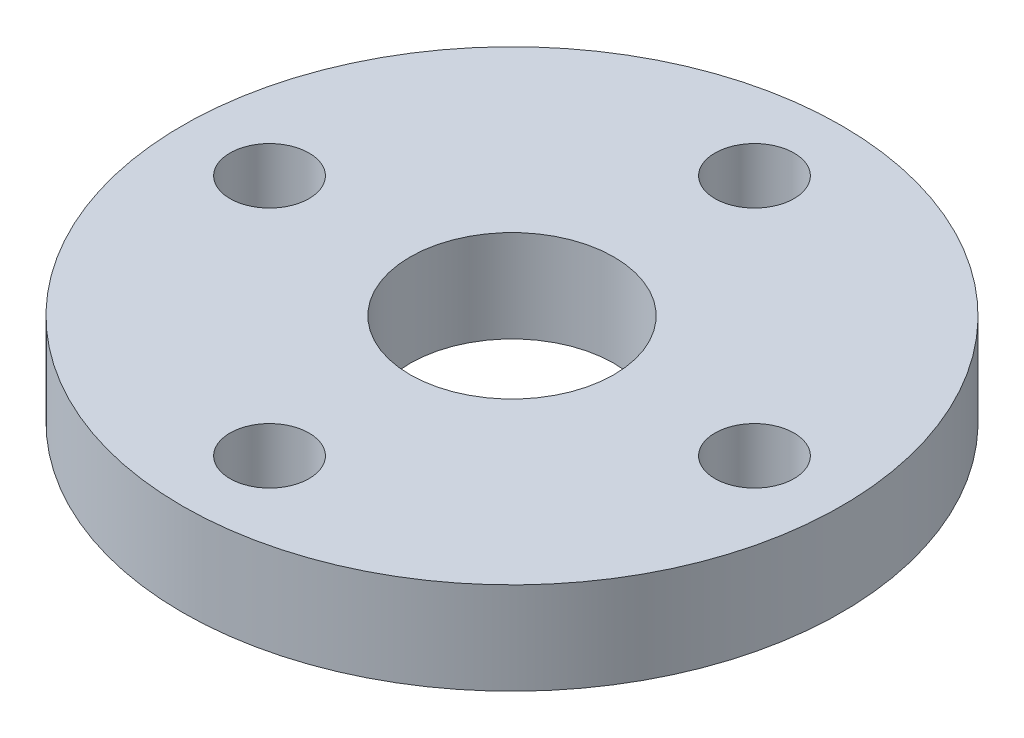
ISO-10303-21;
HEADER;
FILE_DESCRIPTION(('STEP AP214'),'2;1');
FILE_NAME('part.step','',(''),(''),'','','');
FILE_SCHEMA(('AUTOMOTIVE_DESIGN { 1 0 10303 214 1 1 1 1 }'));
ENDSEC;
DATA;
#1=APPLICATION_CONTEXT('core data for automotive mechanical design processes');
#2=APPLICATION_PROTOCOL_DEFINITION('international standard','automotive_design',2000,#1);
#3=PRODUCT_CONTEXT('',#1,'mechanical');
#4=PRODUCT('Part','Part','',(#3));
#5=PRODUCT_RELATED_PRODUCT_CATEGORY('part','',(#4));
#6=PRODUCT_DEFINITION_FORMATION('','',#4);
#7=PRODUCT_DEFINITION_CONTEXT('part definition',#1,'design');
#8=PRODUCT_DEFINITION('design','',#6,#7);
#9=PRODUCT_DEFINITION_SHAPE('','',#8);
#10=(LENGTH_UNIT() NAMED_UNIT(*) SI_UNIT(.MILLI.,.METRE.));
#11=(NAMED_UNIT(*) PLANE_ANGLE_UNIT() SI_UNIT($,.RADIAN.));
#12=(NAMED_UNIT(*) SI_UNIT($,.STERADIAN.) SOLID_ANGLE_UNIT());
#13=UNCERTAINTY_MEASURE_WITH_UNIT(LENGTH_MEASURE(1.E-05),#10,'distance_accuracy_value','');
#14=(GEOMETRIC_REPRESENTATION_CONTEXT(3) GLOBAL_UNCERTAINTY_ASSIGNED_CONTEXT((#13)) GLOBAL_UNIT_ASSIGNED_CONTEXT((#10,
#11,#12)) REPRESENTATION_CONTEXT('',''));
#15=CARTESIAN_POINT('',(0.,0.,0.));
#16=DIRECTION('',(0.,0.,1.));
#17=DIRECTION('',(1.,0.,0.));
#18=AXIS2_PLACEMENT_3D('',#15,#16,#17);
#19=CARTESIAN_POINT('',(0.,15.0876,0.));
#20=DIRECTION('',(0.,1.,0.));
#21=DIRECTION('',(0.,0.,1.));
#22=AXIS2_PLACEMENT_3D('',#19,#20,#21);
#23=PLANE('',#22);
#24=CARTESIAN_POINT('',(-39.7156471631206,15.0876,-4.1599956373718E-13));
#25=DIRECTION('',(0.,1.,0.));
#26=DIRECTION('',(1.,0.,0.));
#27=AXIS2_PLACEMENT_3D('',#24,#25,#26);
#28=CIRCLE('',#27,6.477);
#29=CARTESIAN_POINT('',(-33.2386471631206,15.0876,-3.48156550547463E-13));
#30=VERTEX_POINT('',#29);
#31=EDGE_CURVE('E72',#30,#30,#28,.T.);
#32=ORIENTED_EDGE('',*,*,#31,.F.);
#33=EDGE_LOOP('',(#32));
#34=FACE_BOUND('',#33,.T.);
#35=CARTESIAN_POINT('',(-2.77333042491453E-13,15.0876,39.7156471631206));
#36=DIRECTION('',(0.,1.,0.));
#37=DIRECTION('',(0.,0.,-1.));
#38=AXIS2_PLACEMENT_3D('',#35,#36,#37);
#39=CIRCLE('',#38,6.477);
#40=CARTESIAN_POINT('',(-2.32104367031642E-13,15.0876,33.2386471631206));
#41=VERTEX_POINT('',#40);
#42=EDGE_CURVE('E66',#41,#41,#39,.T.);
#43=ORIENTED_EDGE('',*,*,#42,.F.);
#44=EDGE_LOOP('',(#43));
#45=FACE_BOUND('',#44,.T.);
#46=CARTESIAN_POINT('',(39.7156471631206,15.0876,1.38666521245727E-13));
#47=DIRECTION('',(0.,1.,0.));
#48=DIRECTION('',(-1.,0.,0.));
#49=AXIS2_PLACEMENT_3D('',#46,#47,#48);
#50=CIRCLE('',#49,6.477);
#51=CARTESIAN_POINT('',(33.2386471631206,15.0876,1.16052183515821E-13));
#52=VERTEX_POINT('',#51);
#53=EDGE_CURVE('E60',#52,#52,#50,.T.);
#54=ORIENTED_EDGE('',*,*,#53,.F.);
#55=EDGE_LOOP('',(#54));
#56=FACE_BOUND('',#55,.T.);
#57=CARTESIAN_POINT('',(0.,15.0876,-39.7156471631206));
#58=DIRECTION('',(0.,1.,0.));
#59=DIRECTION('',(0.,0.,1.));
#60=AXIS2_PLACEMENT_3D('',#57,#58,#59);
#61=CIRCLE('',#60,6.477);
#62=CARTESIAN_POINT('',(0.,15.0876,-33.2386471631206));
#63=VERTEX_POINT('',#62);
#64=EDGE_CURVE('E54',#63,#63,#61,.T.);
#65=ORIENTED_EDGE('',*,*,#64,.F.);
#66=EDGE_LOOP('',(#65));
#67=FACE_BOUND('',#66,.T.);
#68=CARTESIAN_POINT('',(0.,15.0876,0.));
#69=DIRECTION('',(0.,1.,0.));
#70=DIRECTION('',(0.,0.,1.));
#71=AXIS2_PLACEMENT_3D('',#68,#69,#70);
#72=CIRCLE('',#71,53.975);
#73=CARTESIAN_POINT('',(0.,15.0876,53.975));
#74=VERTEX_POINT('',#73);
#75=EDGE_CURVE('E10',#74,#74,#72,.T.);
#76=ORIENTED_EDGE('',*,*,#75,.T.);
#77=EDGE_LOOP('',(#76));
#78=FACE_BOUND('',#77,.T.);
#79=CARTESIAN_POINT('',(0.,15.0876,0.));
#80=DIRECTION('',(0.,1.,0.));
#81=DIRECTION('',(0.,0.,1.));
#82=AXIS2_PLACEMENT_3D('',#79,#80,#81);
#83=CIRCLE('',#82,16.7005);
#84=CARTESIAN_POINT('',(0.,15.0876,16.7005));
#85=VERTEX_POINT('',#84);
#86=EDGE_CURVE('E42',#85,#85,#83,.T.);
#87=ORIENTED_EDGE('',*,*,#86,.F.);
#88=EDGE_LOOP('',(#87));
#89=FACE_BOUND('',#88,.T.);
#90=ADVANCED_FACE('F31',(#34,#45,#56,#67,#78,#89),#23,.T.);
#91=CARTESIAN_POINT('',(0.,0.,0.));
#92=DIRECTION('',(0.,1.,0.));
#93=DIRECTION('',(0.,0.,1.));
#94=AXIS2_PLACEMENT_3D('',#91,#92,#93);
#95=PLANE('',#94);
#96=CARTESIAN_POINT('',(-39.7156471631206,0.,-4.1599956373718E-13));
#97=DIRECTION('',(0.,1.,0.));
#98=DIRECTION('',(1.,0.,0.));
#99=AXIS2_PLACEMENT_3D('',#96,#97,#98);
#100=CIRCLE('',#99,6.477);
#101=CARTESIAN_POINT('',(-33.2386471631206,0.,-3.48156550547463E-13));
#102=VERTEX_POINT('',#101);
#103=EDGE_CURVE('E69',#102,#102,#100,.T.);
#104=ORIENTED_EDGE('',*,*,#103,.T.);
#105=EDGE_LOOP('',(#104));
#106=FACE_BOUND('',#105,.T.);
#107=CARTESIAN_POINT('',(-2.77333042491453E-13,0.,39.7156471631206));
#108=DIRECTION('',(0.,1.,0.));
#109=DIRECTION('',(0.,0.,-1.));
#110=AXIS2_PLACEMENT_3D('',#107,#108,#109);
#111=CIRCLE('',#110,6.477);
#112=CARTESIAN_POINT('',(-2.32104367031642E-13,0.,33.2386471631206));
#113=VERTEX_POINT('',#112);
#114=EDGE_CURVE('E63',#113,#113,#111,.T.);
#115=ORIENTED_EDGE('',*,*,#114,.T.);
#116=EDGE_LOOP('',(#115));
#117=FACE_BOUND('',#116,.T.);
#118=CARTESIAN_POINT('',(39.7156471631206,0.,1.38666521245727E-13));
#119=DIRECTION('',(0.,1.,0.));
#120=DIRECTION('',(-1.,0.,0.));
#121=AXIS2_PLACEMENT_3D('',#118,#119,#120);
#122=CIRCLE('',#121,6.477);
#123=CARTESIAN_POINT('',(33.2386471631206,0.,1.16052183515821E-13));
#124=VERTEX_POINT('',#123);
#125=EDGE_CURVE('E57',#124,#124,#122,.T.);
#126=ORIENTED_EDGE('',*,*,#125,.T.);
#127=EDGE_LOOP('',(#126));
#128=FACE_BOUND('',#127,.T.);
#129=CARTESIAN_POINT('',(0.,0.,-39.7156471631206));
#130=DIRECTION('',(0.,1.,0.));
#131=DIRECTION('',(0.,0.,1.));
#132=AXIS2_PLACEMENT_3D('',#129,#130,#131);
#133=CIRCLE('',#132,6.477);
#134=CARTESIAN_POINT('',(0.,0.,-33.2386471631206));
#135=VERTEX_POINT('',#134);
#136=EDGE_CURVE('E51',#135,#135,#133,.T.);
#137=ORIENTED_EDGE('',*,*,#136,.T.);
#138=EDGE_LOOP('',(#137));
#139=FACE_BOUND('',#138,.T.);
#140=CARTESIAN_POINT('',(0.,0.,0.));
#141=DIRECTION('',(0.,1.,0.));
#142=DIRECTION('',(0.,0.,1.));
#143=AXIS2_PLACEMENT_3D('',#140,#141,#142);
#144=CIRCLE('',#143,53.975);
#145=CARTESIAN_POINT('',(0.,0.,53.975));
#146=VERTEX_POINT('',#145);
#147=EDGE_CURVE('E38',#146,#146,#144,.T.);
#148=ORIENTED_EDGE('',*,*,#147,.F.);
#149=EDGE_LOOP('',(#148));
#150=FACE_BOUND('',#149,.T.);
#151=CARTESIAN_POINT('',(0.,0.,0.));
#152=DIRECTION('',(0.,1.,0.));
#153=DIRECTION('',(0.,0.,1.));
#154=AXIS2_PLACEMENT_3D('',#151,#152,#153);
#155=CIRCLE('',#154,16.7005);
#156=CARTESIAN_POINT('',(0.,0.,16.7005));
#157=VERTEX_POINT('',#156);
#158=EDGE_CURVE('E46',#157,#157,#155,.T.);
#159=ORIENTED_EDGE('',*,*,#158,.T.);
#160=EDGE_LOOP('',(#159));
#161=FACE_BOUND('',#160,.T.);
#162=ADVANCED_FACE('F80',(#106,#117,#128,#139,#150,#161),#95,.F.);
#163=CARTESIAN_POINT('',(0.,15.0876,0.));
#164=DIRECTION('',(0.,-1.,0.));
#165=DIRECTION('',(0.,0.,-1.));
#166=AXIS2_PLACEMENT_3D('',#163,#164,#165);
#167=CYLINDRICAL_SURFACE('',#166,53.975);
#168=ORIENTED_EDGE('',*,*,#75,.F.);
#169=EDGE_LOOP('',(#168));
#170=FACE_BOUND('',#169,.T.);
#171=ORIENTED_EDGE('',*,*,#147,.T.);
#172=EDGE_LOOP('',(#171));
#173=FACE_BOUND('',#172,.T.);
#174=ADVANCED_FACE('F33',(#170,#173),#167,.T.);
#175=CARTESIAN_POINT('',(0.,15.0876,0.));
#176=DIRECTION('',(0.,-1.,0.));
#177=DIRECTION('',(0.,0.,-1.));
#178=AXIS2_PLACEMENT_3D('',#175,#176,#177);
#179=CYLINDRICAL_SURFACE('',#178,16.7005);
#180=ORIENTED_EDGE('',*,*,#86,.T.);
#181=EDGE_LOOP('',(#180));
#182=FACE_BOUND('',#181,.T.);
#183=ORIENTED_EDGE('',*,*,#158,.F.);
#184=EDGE_LOOP('',(#183));
#185=FACE_BOUND('',#184,.T.);
#186=ADVANCED_FACE('F89',(#182,#185),#179,.F.);
#187=CARTESIAN_POINT('',(0.,0.,-39.7156471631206));
#188=DIRECTION('',(0.,1.,0.));
#189=DIRECTION('',(0.,0.,1.));
#190=AXIS2_PLACEMENT_3D('',#187,#188,#189);
#191=CYLINDRICAL_SURFACE('',#190,6.477);
#192=ORIENTED_EDGE('',*,*,#136,.F.);
#193=EDGE_LOOP('',(#192));
#194=FACE_BOUND('',#193,.T.);
#195=ORIENTED_EDGE('',*,*,#64,.T.);
#196=EDGE_LOOP('',(#195));
#197=FACE_BOUND('',#196,.T.);
#198=ADVANCED_FACE('F92',(#194,#197),#191,.F.);
#199=CARTESIAN_POINT('',(39.7156471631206,0.,1.38666521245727E-13));
#200=DIRECTION('',(0.,1.,0.));
#201=DIRECTION('',(0.,0.,1.));
#202=AXIS2_PLACEMENT_3D('',#199,#200,#201);
#203=CYLINDRICAL_SURFACE('',#202,6.477);
#204=ORIENTED_EDGE('',*,*,#125,.F.);
#205=EDGE_LOOP('',(#204));
#206=FACE_BOUND('',#205,.T.);
#207=ORIENTED_EDGE('',*,*,#53,.T.);
#208=EDGE_LOOP('',(#207));
#209=FACE_BOUND('',#208,.T.);
#210=ADVANCED_FACE('F107',(#206,#209),#203,.F.);
#211=CARTESIAN_POINT('',(-2.77333042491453E-13,0.,39.7156471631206));
#212=DIRECTION('',(0.,1.,0.));
#213=DIRECTION('',(0.,0.,1.));
#214=AXIS2_PLACEMENT_3D('',#211,#212,#213);
#215=CYLINDRICAL_SURFACE('',#214,6.477);
#216=ORIENTED_EDGE('',*,*,#114,.F.);
#217=EDGE_LOOP('',(#216));
#218=FACE_BOUND('',#217,.T.);
#219=ORIENTED_EDGE('',*,*,#42,.T.);
#220=EDGE_LOOP('',(#219));
#221=FACE_BOUND('',#220,.T.);
#222=ADVANCED_FACE('F111',(#218,#221),#215,.F.);
#223=CARTESIAN_POINT('',(-39.7156471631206,0.,-4.1599956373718E-13));
#224=DIRECTION('',(0.,1.,0.));
#225=DIRECTION('',(0.,0.,1.));
#226=AXIS2_PLACEMENT_3D('',#223,#224,#225);
#227=CYLINDRICAL_SURFACE('',#226,6.477);
#228=ORIENTED_EDGE('',*,*,#103,.F.);
#229=EDGE_LOOP('',(#228));
#230=FACE_BOUND('',#229,.T.);
#231=ORIENTED_EDGE('',*,*,#31,.T.);
#232=EDGE_LOOP('',(#231));
#233=FACE_BOUND('',#232,.T.);
#234=ADVANCED_FACE('F76',(#230,#233),#227,.F.);
#235=CLOSED_SHELL('',(#90,#162,#174,#186,#198,#210,#222,#234));
#236=MANIFOLD_SOLID_BREP('B2',#235);
#237=ADVANCED_BREP_SHAPE_REPRESENTATION('',(#18,#236),#14);
#238=SHAPE_DEFINITION_REPRESENTATION(#9,#237);
ENDSEC;
END-ISO-10303-21;
